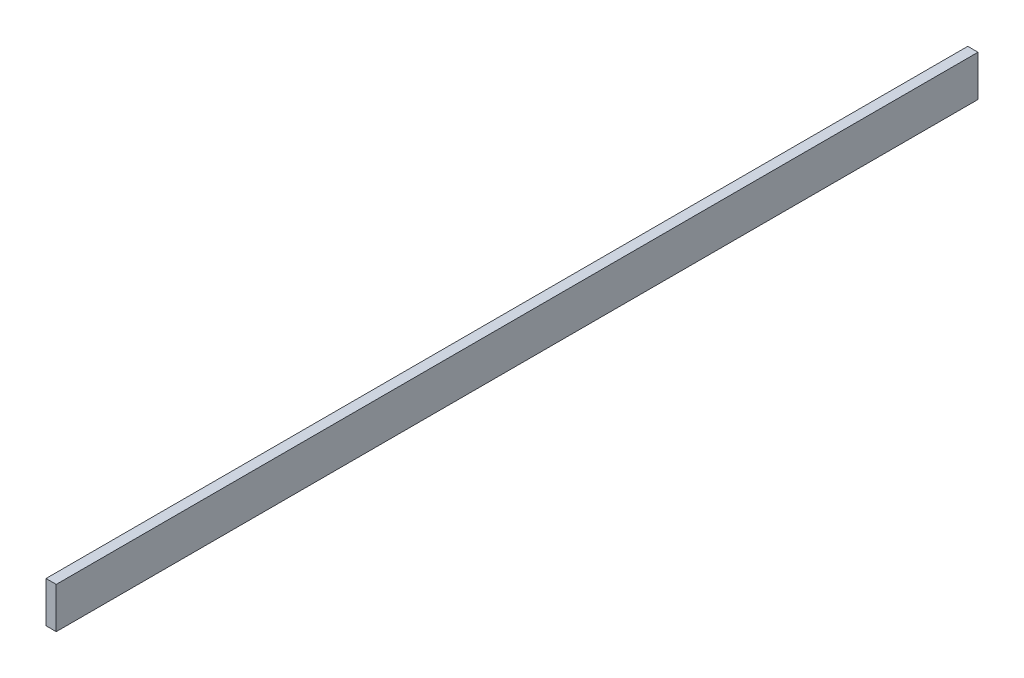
ISO-10303-21;
HEADER;
FILE_DESCRIPTION(('STEP AP214'),'2;1');
FILE_NAME('part.step','',(''),(''),'','','');
FILE_SCHEMA(('AUTOMOTIVE_DESIGN { 1 0 10303 214 1 1 1 1 }'));
ENDSEC;
DATA;
#1=APPLICATION_CONTEXT('core data for automotive mechanical design processes');
#2=APPLICATION_PROTOCOL_DEFINITION('international standard','automotive_design',2000,#1);
#3=PRODUCT_CONTEXT('',#1,'mechanical');
#4=PRODUCT('Part','Part','',(#3));
#5=PRODUCT_RELATED_PRODUCT_CATEGORY('part','',(#4));
#6=PRODUCT_DEFINITION_FORMATION('','',#4);
#7=PRODUCT_DEFINITION_CONTEXT('part definition',#1,'design');
#8=PRODUCT_DEFINITION('design','',#6,#7);
#9=PRODUCT_DEFINITION_SHAPE('','',#8);
#10=(LENGTH_UNIT() NAMED_UNIT(*) SI_UNIT(.MILLI.,.METRE.));
#11=(NAMED_UNIT(*) PLANE_ANGLE_UNIT() SI_UNIT($,.RADIAN.));
#12=(NAMED_UNIT(*) SI_UNIT($,.STERADIAN.) SOLID_ANGLE_UNIT());
#13=UNCERTAINTY_MEASURE_WITH_UNIT(LENGTH_MEASURE(1.E-05),#10,'distance_accuracy_value','');
#14=(GEOMETRIC_REPRESENTATION_CONTEXT(3) GLOBAL_UNCERTAINTY_ASSIGNED_CONTEXT((#13)) GLOBAL_UNIT_ASSIGNED_CONTEXT((#10,
#11,#12)) REPRESENTATION_CONTEXT('',''));
#15=CARTESIAN_POINT('',(0.,0.,0.));
#16=DIRECTION('',(0.,0.,1.));
#17=DIRECTION('',(1.,0.,0.));
#18=AXIS2_PLACEMENT_3D('',#15,#16,#17);
#19=CARTESIAN_POINT('',(12.7,-50.8,2286.));
#20=DIRECTION('',(-1.,0.,0.));
#21=DIRECTION('',(0.,0.,1.));
#22=AXIS2_PLACEMENT_3D('',#19,#20,#21);
#23=PLANE('',#22);
#24=DIRECTION('',(0.,1.,0.));
#25=VECTOR('',#24,1.);
#26=CARTESIAN_POINT('',(12.7,-50.8,0.));
#27=LINE('',#26,#25);
#28=CARTESIAN_POINT('',(12.7,-50.8,0.));
#29=VERTEX_POINT('',#28);
#30=CARTESIAN_POINT('',(12.7,50.8,0.));
#31=VERTEX_POINT('',#30);
#32=EDGE_CURVE('E96',#29,#31,#27,.T.);
#33=ORIENTED_EDGE('',*,*,#32,.T.);
#34=DIRECTION('',(0.,0.,-1.));
#35=VECTOR('',#34,1.);
#36=CARTESIAN_POINT('',(12.7,50.8,2286.));
#37=LINE('',#36,#35);
#38=CARTESIAN_POINT('',(12.7,50.8,2286.));
#39=VERTEX_POINT('',#38);
#40=EDGE_CURVE('E11',#39,#31,#37,.T.);
#41=ORIENTED_EDGE('',*,*,#40,.F.);
#42=DIRECTION('',(0.,1.,0.));
#43=VECTOR('',#42,1.);
#44=CARTESIAN_POINT('',(12.7,-50.8,2286.));
#45=LINE('',#44,#43);
#46=CARTESIAN_POINT('',(12.7,-50.8,2286.));
#47=VERTEX_POINT('',#46);
#48=EDGE_CURVE('E84',#47,#39,#45,.T.);
#49=ORIENTED_EDGE('',*,*,#48,.F.);
#50=DIRECTION('',(0.,0.,-1.));
#51=VECTOR('',#50,1.);
#52=CARTESIAN_POINT('',(12.7,-50.8,2286.));
#53=LINE('',#52,#51);
#54=EDGE_CURVE('E92',#47,#29,#53,.T.);
#55=ORIENTED_EDGE('',*,*,#54,.T.);
#56=EDGE_LOOP('',(#33,#41,#49,#55));
#57=FACE_BOUND('',#56,.T.);
#58=ADVANCED_FACE('F33',(#57),#23,.F.);
#59=CARTESIAN_POINT('',(-12.7,50.8,2286.));
#60=DIRECTION('',(0.,-1.,0.));
#61=DIRECTION('',(0.,0.,-1.));
#62=AXIS2_PLACEMENT_3D('',#59,#60,#61);
#63=PLANE('',#62);
#64=DIRECTION('',(-1.,0.,0.));
#65=VECTOR('',#64,1.);
#66=CARTESIAN_POINT('',(-12.7,50.8,0.));
#67=LINE('',#66,#65);
#68=CARTESIAN_POINT('',(-12.7,50.8,0.));
#69=VERTEX_POINT('',#68);
#70=EDGE_CURVE('E88',#31,#69,#67,.T.);
#71=ORIENTED_EDGE('',*,*,#70,.T.);
#72=DIRECTION('',(0.,0.,-1.));
#73=VECTOR('',#72,1.);
#74=CARTESIAN_POINT('',(-12.7,50.8,2286.));
#75=LINE('',#74,#73);
#76=CARTESIAN_POINT('',(-12.7,50.8,2286.));
#77=VERTEX_POINT('',#76);
#78=EDGE_CURVE('E41',#77,#69,#75,.T.);
#79=ORIENTED_EDGE('',*,*,#78,.F.);
#80=DIRECTION('',(-1.,0.,0.));
#81=VECTOR('',#80,1.);
#82=CARTESIAN_POINT('',(-12.7,50.8,2286.));
#83=LINE('',#82,#81);
#84=EDGE_CURVE('E79',#39,#77,#83,.T.);
#85=ORIENTED_EDGE('',*,*,#84,.F.);
#86=ORIENTED_EDGE('',*,*,#40,.T.);
#87=EDGE_LOOP('',(#71,#79,#85,#86));
#88=FACE_BOUND('',#87,.T.);
#89=ADVANCED_FACE('F87',(#88),#63,.F.);
#90=CARTESIAN_POINT('',(-12.7,-50.8,2286.));
#91=DIRECTION('',(1.,0.,0.));
#92=DIRECTION('',(0.,0.,-1.));
#93=AXIS2_PLACEMENT_3D('',#90,#91,#92);
#94=PLANE('',#93);
#95=DIRECTION('',(0.,-1.,0.));
#96=VECTOR('',#95,1.);
#97=CARTESIAN_POINT('',(-12.7,-50.8,0.));
#98=LINE('',#97,#96);
#99=CARTESIAN_POINT('',(-12.7,-50.8,0.));
#100=VERTEX_POINT('',#99);
#101=EDGE_CURVE('E66',#69,#100,#98,.T.);
#102=ORIENTED_EDGE('',*,*,#101,.T.);
#103=DIRECTION('',(0.,0.,-1.));
#104=VECTOR('',#103,1.);
#105=CARTESIAN_POINT('',(-12.7,-50.8,2286.));
#106=LINE('',#105,#104);
#107=CARTESIAN_POINT('',(-12.7,-50.8,2286.));
#108=VERTEX_POINT('',#107);
#109=EDGE_CURVE('E89',#108,#100,#106,.T.);
#110=ORIENTED_EDGE('',*,*,#109,.F.);
#111=DIRECTION('',(0.,-1.,0.));
#112=VECTOR('',#111,1.);
#113=CARTESIAN_POINT('',(-12.7,-50.8,2286.));
#114=LINE('',#113,#112);
#115=EDGE_CURVE('E82',#77,#108,#114,.T.);
#116=ORIENTED_EDGE('',*,*,#115,.F.);
#117=ORIENTED_EDGE('',*,*,#78,.T.);
#118=EDGE_LOOP('',(#102,#110,#116,#117));
#119=FACE_BOUND('',#118,.T.);
#120=ADVANCED_FACE('F90',(#119),#94,.F.);
#121=CARTESIAN_POINT('',(-12.7,-50.8,2286.));
#122=DIRECTION('',(0.,1.,0.));
#123=DIRECTION('',(0.,0.,1.));
#124=AXIS2_PLACEMENT_3D('',#121,#122,#123);
#125=PLANE('',#124);
#126=DIRECTION('',(1.,0.,0.));
#127=VECTOR('',#126,1.);
#128=CARTESIAN_POINT('',(-12.7,-50.8,0.));
#129=LINE('',#128,#127);
#130=EDGE_CURVE('E72',#100,#29,#129,.T.);
#131=ORIENTED_EDGE('',*,*,#130,.T.);
#132=ORIENTED_EDGE('',*,*,#54,.F.);
#133=DIRECTION('',(1.,0.,0.));
#134=VECTOR('',#133,1.);
#135=CARTESIAN_POINT('',(-12.7,-50.8,2286.));
#136=LINE('',#135,#134);
#137=EDGE_CURVE('E49',#108,#47,#136,.T.);
#138=ORIENTED_EDGE('',*,*,#137,.F.);
#139=ORIENTED_EDGE('',*,*,#109,.T.);
#140=EDGE_LOOP('',(#131,#132,#138,#139));
#141=FACE_BOUND('',#140,.T.);
#142=ADVANCED_FACE('F103',(#141),#125,.F.);
#143=CARTESIAN_POINT('',(0.,0.,2286.));
#144=DIRECTION('',(0.,0.,-1.));
#145=DIRECTION('',(-1.,0.,0.));
#146=AXIS2_PLACEMENT_3D('',#143,#144,#145);
#147=PLANE('',#146);
#148=ORIENTED_EDGE('',*,*,#48,.T.);
#149=ORIENTED_EDGE('',*,*,#84,.T.);
#150=ORIENTED_EDGE('',*,*,#115,.T.);
#151=ORIENTED_EDGE('',*,*,#137,.T.);
#152=EDGE_LOOP('',(#148,#149,#150,#151));
#153=FACE_BOUND('',#152,.T.);
#154=ADVANCED_FACE('F80',(#153),#147,.F.);
#155=CARTESIAN_POINT('',(0.,0.,0.));
#156=DIRECTION('',(0.,0.,-1.));
#157=DIRECTION('',(-1.,0.,0.));
#158=AXIS2_PLACEMENT_3D('',#155,#156,#157);
#159=PLANE('',#158);
#160=ORIENTED_EDGE('',*,*,#32,.F.);
#161=ORIENTED_EDGE('',*,*,#130,.F.);
#162=ORIENTED_EDGE('',*,*,#101,.F.);
#163=ORIENTED_EDGE('',*,*,#70,.F.);
#164=EDGE_LOOP('',(#160,#161,#162,#163));
#165=FACE_BOUND('',#164,.T.);
#166=ADVANCED_FACE('F106',(#165),#159,.T.);
#167=CLOSED_SHELL('',(#58,#89,#120,#142,#154,#166));
#168=MANIFOLD_SOLID_BREP('B2',#167);
#169=ADVANCED_BREP_SHAPE_REPRESENTATION('',(#18,#168),#14);
#170=SHAPE_DEFINITION_REPRESENTATION(#9,#169);
ENDSEC;
END-ISO-10303-21;
